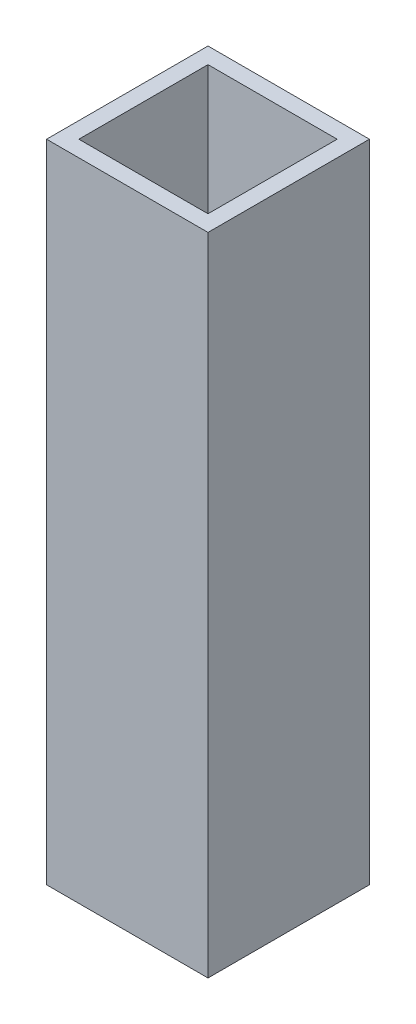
from build123d import *

# Parameters (mm, degrees)
SKETCH_1_W      = 20
SKETCH_1_H      = 20
SKETCH_1_W_2    = 16
SKETCH_1_H_2    = 16
EXTRUDE_1_DEPTH = 80


with BuildPart() as part:
    # Sketch 1 → Extrude 1 (new body)
    with BuildSketch(Plane(origin=(0, 0, 0), x_dir=(1, 0, 0), z_dir=(0, 1, 0))):
        Rectangle(SKETCH_1_W, SKETCH_1_H)
        Rectangle(SKETCH_1_W_2, SKETCH_1_H_2, mode=Mode.SUBTRACT)
    extrude(amount=EXTRUDE_1_DEPTH)


solid = part.part
